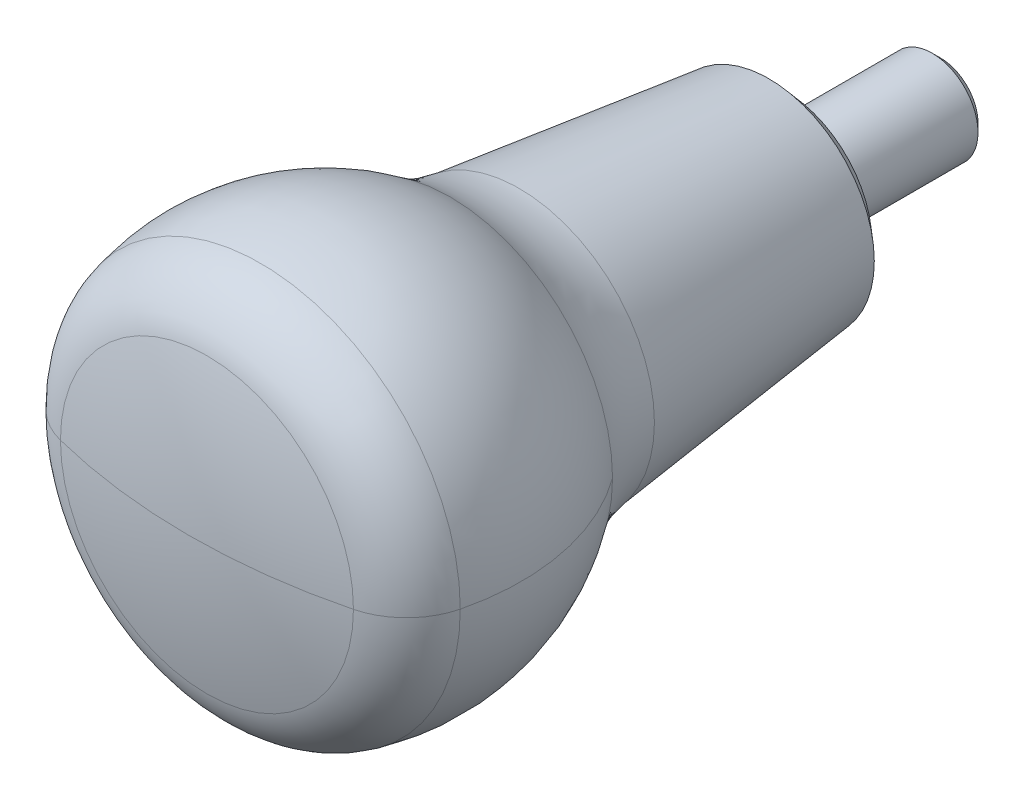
ISO-10303-21;
HEADER;
FILE_DESCRIPTION(('STEP AP214'),'2;1');
FILE_NAME('part.step','',(''),(''),'','','');
FILE_SCHEMA(('AUTOMOTIVE_DESIGN { 1 0 10303 214 1 1 1 1 }'));
ENDSEC;
DATA;
#1=APPLICATION_CONTEXT('core data for automotive mechanical design processes');
#2=APPLICATION_PROTOCOL_DEFINITION('international standard','automotive_design',2000,#1);
#3=PRODUCT_CONTEXT('',#1,'mechanical');
#4=PRODUCT('Part','Part','',(#3));
#5=PRODUCT_RELATED_PRODUCT_CATEGORY('part','',(#4));
#6=PRODUCT_DEFINITION_FORMATION('','',#4);
#7=PRODUCT_DEFINITION_CONTEXT('part definition',#1,'design');
#8=PRODUCT_DEFINITION('design','',#6,#7);
#9=PRODUCT_DEFINITION_SHAPE('','',#8);
#10=(LENGTH_UNIT() NAMED_UNIT(*) SI_UNIT(.MILLI.,.METRE.));
#11=(NAMED_UNIT(*) PLANE_ANGLE_UNIT() SI_UNIT($,.RADIAN.));
#12=(NAMED_UNIT(*) SI_UNIT($,.STERADIAN.) SOLID_ANGLE_UNIT());
#13=UNCERTAINTY_MEASURE_WITH_UNIT(LENGTH_MEASURE(1.E-05),#10,'distance_accuracy_value','');
#14=(GEOMETRIC_REPRESENTATION_CONTEXT(3) GLOBAL_UNCERTAINTY_ASSIGNED_CONTEXT((#13)) GLOBAL_UNIT_ASSIGNED_CONTEXT((#10,
#11,#12)) REPRESENTATION_CONTEXT('',''));
#15=CARTESIAN_POINT('',(0.,0.,0.));
#16=DIRECTION('',(0.,0.,1.));
#17=DIRECTION('',(1.,0.,0.));
#18=AXIS2_PLACEMENT_3D('',#15,#16,#17);
#19=CARTESIAN_POINT('',(0.,-2.04,-16.8));
#20=DIRECTION('',(0.,0.,-1.));
#21=DIRECTION('',(-1.,0.,0.));
#22=AXIS2_PLACEMENT_3D('',#19,#20,#21);
#23=PLANE('',#22);
#24=DIRECTION('',(0.866025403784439,0.5,0.));
#25=VECTOR('',#24,1.);
#26=CARTESIAN_POINT('',(-2.5,1.44337567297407,-16.8));
#27=LINE('',#26,#25);
#28=CARTESIAN_POINT('',(-2.5,1.44337567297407,-16.8));
#29=VERTEX_POINT('',#28);
#30=CARTESIAN_POINT('',(0.,2.88675134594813,-16.8));
#31=VERTEX_POINT('',#30);
#32=EDGE_CURVE('E32',#29,#31,#27,.T.);
#33=ORIENTED_EDGE('',*,*,#32,.F.);
#34=DIRECTION('',(0.,1.,0.));
#35=VECTOR('',#34,1.);
#36=CARTESIAN_POINT('',(-2.5,-1.44337567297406,-16.8));
#37=LINE('',#36,#35);
#38=CARTESIAN_POINT('',(-2.5,-1.44337567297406,-16.8));
#39=VERTEX_POINT('',#38);
#40=EDGE_CURVE('E214',#39,#29,#37,.T.);
#41=ORIENTED_EDGE('',*,*,#40,.F.);
#42=DIRECTION('',(-0.866025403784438,0.5,0.));
#43=VECTOR('',#42,1.);
#44=CARTESIAN_POINT('',(0.,-2.88675134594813,-16.8));
#45=LINE('',#44,#43);
#46=CARTESIAN_POINT('',(0.,-2.88675134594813,-16.8));
#47=VERTEX_POINT('',#46);
#48=EDGE_CURVE('E583',#47,#39,#45,.T.);
#49=ORIENTED_EDGE('',*,*,#48,.F.);
#50=DIRECTION('',(-0.866025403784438,-0.5,0.));
#51=VECTOR('',#50,1.);
#52=CARTESIAN_POINT('',(2.5,-1.44337567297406,-16.8));
#53=LINE('',#52,#51);
#54=CARTESIAN_POINT('',(2.5,-1.44337567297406,-16.8));
#55=VERTEX_POINT('',#54);
#56=EDGE_CURVE('E581',#55,#47,#53,.T.);
#57=ORIENTED_EDGE('',*,*,#56,.F.);
#58=DIRECTION('',(0.,-1.,0.));
#59=VECTOR('',#58,1.);
#60=CARTESIAN_POINT('',(2.5,1.44337567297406,-16.8));
#61=LINE('',#60,#59);
#62=CARTESIAN_POINT('',(2.5,1.44337567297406,-16.8));
#63=VERTEX_POINT('',#62);
#64=EDGE_CURVE('E574',#63,#55,#61,.T.);
#65=ORIENTED_EDGE('',*,*,#64,.F.);
#66=DIRECTION('',(0.866025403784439,-0.5,0.));
#67=VECTOR('',#66,1.);
#68=CARTESIAN_POINT('',(0.,2.88675134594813,-16.8));
#69=LINE('',#68,#67);
#70=EDGE_CURVE('E571',#31,#63,#69,.T.);
#71=ORIENTED_EDGE('',*,*,#70,.F.);
#72=EDGE_LOOP('',(#33,#41,#49,#57,#65,#71));
#73=FACE_BOUND('',#72,.T.);
#74=CARTESIAN_POINT('',(0.,0.,-16.8));
#75=DIRECTION('',(0.,0.,1.));
#76=DIRECTION('',(0.,1.,0.));
#77=AXIS2_PLACEMENT_3D('',#74,#75,#76);
#78=CIRCLE('',#77,4.08000000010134);
#79=CARTESIAN_POINT('',(0.,4.08000000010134,-16.8));
#80=VERTEX_POINT('',#79);
#81=EDGE_CURVE('E189',#80,#80,#78,.T.);
#82=ORIENTED_EDGE('',*,*,#81,.F.);
#83=EDGE_LOOP('',(#82));
#84=FACE_BOUND('',#83,.T.);
#85=ADVANCED_FACE('F14',(#73,#84),#23,.T.);
#86=CARTESIAN_POINT('',(0.,0.,-15.880000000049));
#87=DIRECTION('',(0.,0.,1.));
#88=DIRECTION('',(0.,1.,0.));
#89=AXIS2_PLACEMENT_3D('',#86,#87,#88);
#90=CONICAL_SURFACE('',#89,5.0000000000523,0.785398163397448);
#91=CARTESIAN_POINT('',(0.,0.,-15.88));
#92=DIRECTION('',(0.,0.,-1.));
#93=DIRECTION('',(0.,-1.,0.));
#94=AXIS2_PLACEMENT_3D('',#91,#92,#93);
#95=CIRCLE('',#94,5.);
#96=CARTESIAN_POINT('',(0.,-5.,-15.88));
#97=VERTEX_POINT('',#96);
#98=EDGE_CURVE('E186',#97,#97,#95,.F.);
#99=ORIENTED_EDGE('',*,*,#98,.F.);
#100=EDGE_LOOP('',(#99));
#101=FACE_BOUND('',#100,.T.);
#102=ORIENTED_EDGE('',*,*,#81,.T.);
#103=EDGE_LOOP('',(#102));
#104=FACE_BOUND('',#103,.T.);
#105=ADVANCED_FACE('F442',(#101,#104),#90,.T.);
#106=CARTESIAN_POINT('',(0.,0.,-9.2));
#107=DIRECTION('',(0.,0.,-1.));
#108=DIRECTION('',(0.,-1.,0.));
#109=AXIS2_PLACEMENT_3D('',#106,#107,#108);
#110=CYLINDRICAL_SURFACE('',#109,5.);
#111=CARTESIAN_POINT('',(0.,0.,-2.51999999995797));
#112=DIRECTION('',(0.,0.,-1.));
#113=DIRECTION('',(0.,-1.,0.));
#114=AXIS2_PLACEMENT_3D('',#111,#112,#113);
#115=CIRCLE('',#114,4.99999999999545);
#116=CARTESIAN_POINT('',(0.,-4.99999999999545,-2.51999999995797));
#117=VERTEX_POINT('',#116);
#118=EDGE_CURVE('E178',#117,#117,#115,.F.);
#119=ORIENTED_EDGE('',*,*,#118,.F.);
#120=EDGE_LOOP('',(#119));
#121=FACE_BOUND('',#120,.T.);
#122=ORIENTED_EDGE('',*,*,#98,.T.);
#123=EDGE_LOOP('',(#122));
#124=FACE_BOUND('',#123,.T.);
#125=ADVANCED_FACE('F451',(#121,#124),#110,.T.);
#126=CARTESIAN_POINT('',(0.,0.,-2.51999999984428));
#127=DIRECTION('',(0.,0.,-1.));
#128=DIRECTION('',(-1.,0.,0.));
#129=AXIS2_PLACEMENT_3D('',#126,#127,#128);
#130=CONICAL_SURFACE('',#129,4.99999999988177,0.785398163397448);
#131=CARTESIAN_POINT('',(0.,0.,-1.60000000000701));
#132=DIRECTION('',(0.,0.,-1.));
#133=DIRECTION('',(-1.,0.,0.));
#134=AXIS2_PLACEMENT_3D('',#131,#132,#133);
#135=CIRCLE('',#134,4.0800000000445);
#136=CARTESIAN_POINT('',(-4.0800000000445,0.,-1.60000000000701));
#137=VERTEX_POINT('',#136);
#138=EDGE_CURVE('E104',#137,#137,#135,.F.);
#139=ORIENTED_EDGE('',*,*,#138,.F.);
#140=EDGE_LOOP('',(#139));
#141=FACE_BOUND('',#140,.T.);
#142=ORIENTED_EDGE('',*,*,#118,.T.);
#143=EDGE_LOOP('',(#142));
#144=FACE_BOUND('',#143,.T.);
#145=ADVANCED_FACE('F460',(#141,#144),#130,.T.);
#146=CARTESIAN_POINT('',(0.,-4.04,-1.6));
#147=DIRECTION('',(0.,0.,1.));
#148=DIRECTION('',(1.,0.,0.));
#149=AXIS2_PLACEMENT_3D('',#146,#147,#148);
#150=PLANE('',#149);
#151=ORIENTED_EDGE('',*,*,#138,.T.);
#152=EDGE_LOOP('',(#151));
#153=FACE_BOUND('',#152,.T.);
#154=CARTESIAN_POINT('',(0.,0.,-1.6));
#155=DIRECTION('',(0.,0.,1.));
#156=DIRECTION('',(-1.,0.,0.));
#157=AXIS2_PLACEMENT_3D('',#154,#155,#156);
#158=CIRCLE('',#157,4.);
#159=CARTESIAN_POINT('',(0.,-4.,-1.6));
#160=VERTEX_POINT('',#159);
#161=CARTESIAN_POINT('',(-4.,0.,-1.6));
#162=VERTEX_POINT('',#161);
#163=EDGE_CURVE('E88',#160,#162,#158,.F.);
#164=ORIENTED_EDGE('',*,*,#163,.T.);
#165=CARTESIAN_POINT('',(0.,0.,-1.6));
#166=DIRECTION('',(0.,0.,1.));
#167=DIRECTION('',(1.,0.,0.));
#168=AXIS2_PLACEMENT_3D('',#165,#166,#167);
#169=CIRCLE('',#168,4.);
#170=CARTESIAN_POINT('',(4.,0.,-1.6));
#171=VERTEX_POINT('',#170);
#172=EDGE_CURVE('E92',#162,#171,#169,.F.);
#173=ORIENTED_EDGE('',*,*,#172,.T.);
#174=CARTESIAN_POINT('',(0.,0.,-1.6));
#175=DIRECTION('',(0.,0.,1.));
#176=DIRECTION('',(0.,-1.,0.));
#177=AXIS2_PLACEMENT_3D('',#174,#175,#176);
#178=CIRCLE('',#177,4.);
#179=EDGE_CURVE('E95',#171,#160,#178,.F.);
#180=ORIENTED_EDGE('',*,*,#179,.T.);
#181=EDGE_LOOP('',(#164,#173,#180));
#182=FACE_BOUND('',#181,.T.);
#183=ADVANCED_FACE('F91',(#153,#182),#150,.T.);
#184=CARTESIAN_POINT('',(0.,0.,-1.4));
#185=DIRECTION('',(0.,0.,1.));
#186=DIRECTION('',(1.,0.,0.));
#187=AXIS2_PLACEMENT_3D('',#184,#185,#186);
#188=TOROIDAL_SURFACE('',#187,4.,0.2);
#189=CARTESIAN_POINT('',(0.,0.,-1.4));
#190=DIRECTION('',(0.,0.,-1.));
#191=DIRECTION('',(0.,-1.,0.));
#192=AXIS2_PLACEMENT_3D('',#189,#190,#191);
#193=CIRCLE('',#192,3.8);
#194=CARTESIAN_POINT('',(0.,-3.8,-1.4));
#195=VERTEX_POINT('',#194);
#196=EDGE_CURVE('E99',#195,#195,#193,.F.);
#197=ORIENTED_EDGE('',*,*,#196,.F.);
#198=EDGE_LOOP('',(#197));
#199=FACE_BOUND('',#198,.T.);
#200=ORIENTED_EDGE('',*,*,#163,.F.);
#201=ORIENTED_EDGE('',*,*,#179,.F.);
#202=ORIENTED_EDGE('',*,*,#172,.F.);
#203=EDGE_LOOP('',(#200,#201,#202));
#204=FACE_BOUND('',#203,.T.);
#205=ADVANCED_FACE('F102',(#199,#204),#188,.F.);
#206=CARTESIAN_POINT('',(0.,0.,-0.925));
#207=DIRECTION('',(0.,0.,-1.));
#208=DIRECTION('',(0.,-1.,0.));
#209=AXIS2_PLACEMENT_3D('',#206,#207,#208);
#210=CYLINDRICAL_SURFACE('',#209,3.8);
#211=ORIENTED_EDGE('',*,*,#196,.T.);
#212=EDGE_LOOP('',(#211));
#213=FACE_BOUND('',#212,.T.);
#214=CARTESIAN_POINT('',(0.,0.,-0.45));
#215=DIRECTION('',(0.,0.,1.));
#216=DIRECTION('',(1.,0.,0.));
#217=AXIS2_PLACEMENT_3D('',#214,#215,#216);
#218=CIRCLE('',#217,3.8);
#219=CARTESIAN_POINT('',(3.8,0.,-0.45));
#220=VERTEX_POINT('',#219);
#221=EDGE_CURVE('E153',#220,#220,#218,.F.);
#222=ORIENTED_EDGE('',*,*,#221,.T.);
#223=EDGE_LOOP('',(#222));
#224=FACE_BOUND('',#223,.T.);
#225=ADVANCED_FACE('F123',(#213,#224),#210,.T.);
#226=CARTESIAN_POINT('',(0.,0.,-0.45));
#227=DIRECTION('',(0.,0.,1.));
#228=DIRECTION('',(1.,0.,0.));
#229=AXIS2_PLACEMENT_3D('',#226,#227,#228);
#230=TOROIDAL_SURFACE('',#229,4.25,0.45);
#231=CARTESIAN_POINT('',(0.,0.,0.));
#232=DIRECTION('',(0.,0.,-1.));
#233=DIRECTION('',(0.,-1.,0.));
#234=AXIS2_PLACEMENT_3D('',#231,#232,#233);
#235=CIRCLE('',#234,4.25);
#236=CARTESIAN_POINT('',(-4.25,0.,0.));
#237=VERTEX_POINT('',#236);
#238=CARTESIAN_POINT('',(0.,-4.25,0.));
#239=VERTEX_POINT('',#238);
#240=EDGE_CURVE('E137',#237,#239,#235,.F.);
#241=ORIENTED_EDGE('',*,*,#240,.F.);
#242=CARTESIAN_POINT('',(0.,0.,0.));
#243=DIRECTION('',(0.,0.,-1.));
#244=DIRECTION('',(-1.,0.,0.));
#245=AXIS2_PLACEMENT_3D('',#242,#243,#244);
#246=CIRCLE('',#245,4.25);
#247=CARTESIAN_POINT('',(4.25,0.,0.));
#248=VERTEX_POINT('',#247);
#249=EDGE_CURVE('E626',#248,#237,#246,.F.);
#250=ORIENTED_EDGE('',*,*,#249,.F.);
#251=CARTESIAN_POINT('',(0.,0.,0.));
#252=DIRECTION('',(0.,0.,-1.));
#253=DIRECTION('',(1.,0.,0.));
#254=AXIS2_PLACEMENT_3D('',#251,#252,#253);
#255=CIRCLE('',#254,4.25);
#256=EDGE_CURVE('E149',#239,#248,#255,.F.);
#257=ORIENTED_EDGE('',*,*,#256,.F.);
#258=EDGE_LOOP('',(#241,#250,#257));
#259=FACE_BOUND('',#258,.T.);
#260=ORIENTED_EDGE('',*,*,#221,.F.);
#261=EDGE_LOOP('',(#260));
#262=FACE_BOUND('',#261,.T.);
#263=ADVANCED_FACE('F111',(#259,#262),#230,.F.);
#264=CARTESIAN_POINT('',(0.,-5.125,0.));
#265=DIRECTION('',(0.,0.,-1.));
#266=DIRECTION('',(-1.,0.,0.));
#267=AXIS2_PLACEMENT_3D('',#264,#265,#266);
#268=PLANE('',#267);
#269=ORIENTED_EDGE('',*,*,#249,.T.);
#270=ORIENTED_EDGE('',*,*,#240,.T.);
#271=ORIENTED_EDGE('',*,*,#256,.T.);
#272=EDGE_LOOP('',(#269,#270,#271));
#273=FACE_BOUND('',#272,.T.);
#274=CARTESIAN_POINT('',(0.,0.,0.));
#275=DIRECTION('',(0.,0.,-1.));
#276=DIRECTION('',(0.,-1.,0.));
#277=AXIS2_PLACEMENT_3D('',#274,#275,#276);
#278=CIRCLE('',#277,6.);
#279=CARTESIAN_POINT('',(0.,-6.,0.));
#280=VERTEX_POINT('',#279);
#281=EDGE_CURVE('E197',#280,#280,#278,.F.);
#282=ORIENTED_EDGE('',*,*,#281,.F.);
#283=EDGE_LOOP('',(#282));
#284=FACE_BOUND('',#283,.T.);
#285=ADVANCED_FACE('F122',(#273,#284),#268,.T.);
#286=CARTESIAN_POINT('',(0.,0.,0.0999999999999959));
#287=DIRECTION('',(0.,0.,-1.));
#288=DIRECTION('',(0.,-1.,0.));
#289=AXIS2_PLACEMENT_3D('',#286,#287,#288);
#290=CYLINDRICAL_SURFACE('',#289,6.);
#291=CARTESIAN_POINT('',(0.,0.,0.2));
#292=DIRECTION('',(0.,0.,-1.));
#293=DIRECTION('',(0.,-1.,0.));
#294=AXIS2_PLACEMENT_3D('',#291,#292,#293);
#295=CIRCLE('',#294,6.);
#296=CARTESIAN_POINT('',(0.,-6.,0.2));
#297=VERTEX_POINT('',#296);
#298=EDGE_CURVE('E194',#297,#297,#295,.F.);
#299=ORIENTED_EDGE('',*,*,#298,.F.);
#300=EDGE_LOOP('',(#299));
#301=FACE_BOUND('',#300,.T.);
#302=ORIENTED_EDGE('',*,*,#281,.T.);
#303=EDGE_LOOP('',(#302));
#304=FACE_BOUND('',#303,.T.);
#305=ADVANCED_FACE('F305',(#301,#304),#290,.T.);
#306=CARTESIAN_POINT('',(0.,-7.75,0.2));
#307=DIRECTION('',(0.,0.,-1.));
#308=DIRECTION('',(-1.,0.,0.));
#309=AXIS2_PLACEMENT_3D('',#306,#307,#308);
#310=PLANE('',#309);
#311=ORIENTED_EDGE('',*,*,#298,.T.);
#312=EDGE_LOOP('',(#311));
#313=FACE_BOUND('',#312,.T.);
#314=CARTESIAN_POINT('',(0.,0.,0.200000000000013));
#315=DIRECTION('',(0.,0.,1.));
#316=DIRECTION('',(1.,0.,0.));
#317=AXIS2_PLACEMENT_3D('',#314,#315,#316);
#318=CIRCLE('',#317,9.5);
#319=CARTESIAN_POINT('',(9.5,0.,0.200000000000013));
#320=VERTEX_POINT('',#319);
#321=EDGE_CURVE('E190',#320,#320,#318,.T.);
#322=ORIENTED_EDGE('',*,*,#321,.F.);
#323=EDGE_LOOP('',(#322));
#324=FACE_BOUND('',#323,.T.);
#325=ADVANCED_FACE('F302',(#313,#324),#310,.T.);
#326=CARTESIAN_POINT('',(-5.14556505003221E-05,0.,0.199172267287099));
#327=DIRECTION('',(0.,1.,0.));
#328=DIRECTION('',(1.,0.,0.));
#329=AXIS2_PLACEMENT_3D('',#326,#327,#328);
#330=CIRCLE('',#329,65.0008277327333);
#331=TRIMMED_CURVE('',#330,(PARAMETER_VALUE(-1.57079553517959)),
(PARAMETER_VALUE(1.57079553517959)),.T.,.PARAMETER.);
#332=CARTESIAN_POINT('',(0.,0.,0.199172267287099));
#333=DIRECTION('',(0.,0.,1.));
#334=AXIS1_PLACEMENT('',#332,#333);
#335=SURFACE_OF_REVOLUTION('',#331,#334);
#336=CARTESIAN_POINT('',(-5.14556505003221E-05,0.,0.199172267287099));
#337=DIRECTION('',(0.,1.,0.));
#338=DIRECTION('',(1.,0.,0.));
#339=AXIS2_PLACEMENT_3D('',#336,#337,#338);
#340=CIRCLE('',#339,65.0008277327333);
#341=CARTESIAN_POINT('',(15.9766122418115,0.,63.2059482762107));
#342=VERTEX_POINT('',#341);
#343=CARTESIAN_POINT('',(0.,0.,65.2));
#344=VERTEX_POINT('',#343);
#345=EDGE_CURVE('E287',#342,#344,#340,.F.);
#346=ORIENTED_EDGE('',*,*,#345,.F.);
#347=CARTESIAN_POINT('',(0.,0.,63.2059482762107));
#348=DIRECTION('',(0.,0.,1.));
#349=DIRECTION('',(1.,0.,0.));
#350=AXIS2_PLACEMENT_3D('',#347,#348,#349);
#351=CIRCLE('',#350,15.9766122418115);
#352=CARTESIAN_POINT('',(-15.9766122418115,0.,63.2059482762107));
#353=VERTEX_POINT('',#352);
#354=EDGE_CURVE('E284',#353,#342,#351,.F.);
#355=ORIENTED_EDGE('',*,*,#354,.F.);
#356=CARTESIAN_POINT('',(5.14556505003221E-05,0.,0.199172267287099));
#357=DIRECTION('',(0.,-1.,0.));
#358=DIRECTION('',(-1.,0.,0.));
#359=AXIS2_PLACEMENT_3D('',#356,#357,#358);
#360=CIRCLE('',#359,65.0008277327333);
#361=EDGE_CURVE('E193',#344,#353,#360,.T.);
#362=ORIENTED_EDGE('',*,*,#361,.F.);
#363=EDGE_LOOP('',(#346,#355,#362));
#364=FACE_BOUND('',#363,.T.);
#365=ADVANCED_FACE('F298',(#364),#335,.F.);
#366=CARTESIAN_POINT('',(0.,0.,1.92843217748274));
#367=DIRECTION('',(0.,0.,1.));
#368=DIRECTION('',(1.,0.,0.));
#369=AXIS2_PLACEMENT_3D('',#366,#367,#368);
#370=CONICAL_SURFACE('',#369,11.5,0.858106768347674);
#371=CARTESIAN_POINT('',(0.,0.,1.9284321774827));
#372=DIRECTION('',(0.,0.,1.));
#373=DIRECTION('',(0.,-1.,0.));
#374=AXIS2_PLACEMENT_3D('',#371,#372,#373);
#375=CIRCLE('',#374,11.5);
#376=CARTESIAN_POINT('',(0.,-11.5,1.9284321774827));
#377=VERTEX_POINT('',#376);
#378=EDGE_CURVE('E286',#377,#377,#375,.T.);
#379=ORIENTED_EDGE('',*,*,#378,.F.);
#380=EDGE_LOOP('',(#379));
#381=FACE_BOUND('',#380,.T.);
#382=ORIENTED_EDGE('',*,*,#321,.T.);
#383=EDGE_LOOP('',(#382));
#384=FACE_BOUND('',#383,.T.);
#385=ADVANCED_FACE('F301',(#381,#384),#370,.T.);
#386=CARTESIAN_POINT('',(-5.14556505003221E-05,0.,0.199172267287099));
#387=DIRECTION('',(0.,1.,0.));
#388=DIRECTION('',(1.,0.,0.));
#389=AXIS2_PLACEMENT_3D('',#386,#387,#388);
#390=CIRCLE('',#389,65.0008277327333);
#391=TRIMMED_CURVE('',#390,(PARAMETER_VALUE(-1.57079553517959)),
(PARAMETER_VALUE(1.57079553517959)),.T.,.PARAMETER.);
#392=CARTESIAN_POINT('',(0.,0.,0.199172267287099));
#393=DIRECTION('',(0.,0.,1.));
#394=AXIS1_PLACEMENT('',#392,#393);
#395=SURFACE_OF_REVOLUTION('',#391,#394);
#396=CARTESIAN_POINT('',(0.,0.,63.2059482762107));
#397=DIRECTION('',(0.,0.,1.));
#398=DIRECTION('',(1.,0.,0.));
#399=AXIS2_PLACEMENT_3D('',#396,#397,#398);
#400=CIRCLE('',#399,15.9766122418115);
#401=CARTESIAN_POINT('',(0.,-15.9766122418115,63.2059482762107));
#402=VERTEX_POINT('',#401);
#403=EDGE_CURVE('E333',#342,#402,#400,.F.);
#404=ORIENTED_EDGE('',*,*,#403,.F.);
#405=ORIENTED_EDGE('',*,*,#345,.T.);
#406=ORIENTED_EDGE('',*,*,#361,.T.);
#407=CARTESIAN_POINT('',(0.,0.,63.2059482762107));
#408=DIRECTION('',(0.,0.,1.));
#409=DIRECTION('',(1.,0.,0.));
#410=AXIS2_PLACEMENT_3D('',#407,#408,#409);
#411=CIRCLE('',#410,15.9766122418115);
#412=EDGE_CURVE('E336',#402,#353,#411,.F.);
#413=ORIENTED_EDGE('',*,*,#412,.F.);
#414=EDGE_LOOP('',(#404,#405,#406,#413));
#415=FACE_BOUND('',#414,.T.);
#416=ADVANCED_FACE('F275',(#415),#395,.F.);
#417=CARTESIAN_POINT('',(0.,0.,55.451386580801));
#418=DIRECTION('',(0.,0.,1.));
#419=DIRECTION('',(1.,0.,0.));
#420=AXIS2_PLACEMENT_3D('',#417,#418,#419);
#421=TOROIDAL_SURFACE('',#420,14.0102198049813,7.99999539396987);
#422=CARTESIAN_POINT('',(-14.0102198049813,0.,55.451386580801));
#423=DIRECTION('',(0.,-1.,0.));
#424=DIRECTION('',(-1.,0.,0.));
#425=AXIS2_PLACEMENT_3D('',#422,#423,#424);
#426=CIRCLE('',#425,7.99999539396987);
#427=CARTESIAN_POINT('',(-21.7797205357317,0.,57.3578977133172));
#428=VERTEX_POINT('',#427);
#429=EDGE_CURVE('E259',#353,#428,#426,.T.);
#430=ORIENTED_EDGE('',*,*,#429,.F.);
#431=ORIENTED_EDGE('',*,*,#354,.T.);
#432=CARTESIAN_POINT('',(14.0102198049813,0.,55.451386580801));
#433=DIRECTION('',(0.,1.,0.));
#434=DIRECTION('',(1.,0.,0.));
#435=AXIS2_PLACEMENT_3D('',#432,#433,#434);
#436=CIRCLE('',#435,7.99999539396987);
#437=CARTESIAN_POINT('',(21.7797205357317,0.,57.3578977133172));
#438=VERTEX_POINT('',#437);
#439=EDGE_CURVE('E282',#438,#342,#436,.F.);
#440=ORIENTED_EDGE('',*,*,#439,.F.);
#441=CARTESIAN_POINT('',(0.,0.,57.3578977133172));
#442=DIRECTION('',(0.,0.,1.));
#443=DIRECTION('',(1.,0.,0.));
#444=AXIS2_PLACEMENT_3D('',#441,#442,#443);
#445=CIRCLE('',#444,21.7797205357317);
#446=EDGE_CURVE('E253',#428,#438,#445,.F.);
#447=ORIENTED_EDGE('',*,*,#446,.F.);
#448=EDGE_LOOP('',(#430,#431,#440,#447));
#449=FACE_BOUND('',#448,.T.);
#450=ADVANCED_FACE('F270',(#449),#421,.T.);
#451=CARTESIAN_POINT('',(0.,0.,29.1578448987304));
#452=DIRECTION('',(0.,0.,1.));
#453=DIRECTION('',(1.,0.,0.));
#454=AXIS2_PLACEMENT_3D('',#451,#452,#453);
#455=CONICAL_SURFACE('',#454,14.7528672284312,0.118898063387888);
#456=CARTESIAN_POINT('',(0.,0.,29.1578448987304));
#457=DIRECTION('',(0.,0.,1.));
#458=DIRECTION('',(1.,0.,0.));
#459=AXIS2_PLACEMENT_3D('',#456,#457,#458);
#460=CIRCLE('',#459,14.7528672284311);
#461=CARTESIAN_POINT('',(14.7528672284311,0.,29.1578448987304));
#462=VERTEX_POINT('',#461);
#463=EDGE_CURVE('E251',#462,#462,#460,.F.);
#464=ORIENTED_EDGE('',*,*,#463,.T.);
#465=EDGE_LOOP('',(#464));
#466=FACE_BOUND('',#465,.T.);
#467=ORIENTED_EDGE('',*,*,#378,.T.);
#468=EDGE_LOOP('',(#467));
#469=FACE_BOUND('',#468,.T.);
#470=ADVANCED_FACE('F266',(#466,#469),#455,.T.);
#471=CARTESIAN_POINT('',(0.,0.,55.451386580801));
#472=DIRECTION('',(0.,0.,1.));
#473=DIRECTION('',(1.,0.,0.));
#474=AXIS2_PLACEMENT_3D('',#471,#472,#473);
#475=TOROIDAL_SURFACE('',#474,14.0102198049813,7.99999539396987);
#476=CARTESIAN_POINT('',(0.,0.,57.3578977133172));
#477=DIRECTION('',(0.,0.,1.));
#478=DIRECTION('',(1.,0.,0.));
#479=AXIS2_PLACEMENT_3D('',#476,#477,#478);
#480=CIRCLE('',#479,21.7797205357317);
#481=CARTESIAN_POINT('',(0.,-21.7797205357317,57.3578977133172));
#482=VERTEX_POINT('',#481);
#483=EDGE_CURVE('E342',#482,#428,#480,.F.);
#484=ORIENTED_EDGE('',*,*,#483,.F.);
#485=CARTESIAN_POINT('',(0.,0.,57.3578977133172));
#486=DIRECTION('',(0.,0.,1.));
#487=DIRECTION('',(1.,0.,0.));
#488=AXIS2_PLACEMENT_3D('',#485,#486,#487);
#489=CIRCLE('',#488,21.7797205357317);
#490=EDGE_CURVE('E346',#438,#482,#489,.F.);
#491=ORIENTED_EDGE('',*,*,#490,.F.);
#492=ORIENTED_EDGE('',*,*,#439,.T.);
#493=ORIENTED_EDGE('',*,*,#403,.T.);
#494=ORIENTED_EDGE('',*,*,#412,.T.);
#495=ORIENTED_EDGE('',*,*,#429,.T.);
#496=EDGE_LOOP('',(#484,#491,#492,#493,#494,#495));
#497=FACE_BOUND('',#496,.T.);
#498=ADVANCED_FACE('F263',(#497),#475,.T.);
#499=CARTESIAN_POINT('',(-2.50001842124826,0.,51.4001080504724));
#500=DIRECTION('',(0.,1.,0.));
#501=DIRECTION('',(1.,0.,0.));
#502=AXIS2_PLACEMENT_3D('',#499,#500,#501);
#503=CIRCLE('',#502,25.0000196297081);
#504=TRIMMED_CURVE('',#503,(PARAMETER_VALUE(-1.47062824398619)),
(PARAMETER_VALUE(1.47062824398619)),.T.,.PARAMETER.);
#505=CARTESIAN_POINT('',(0.,0.,51.4001080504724));
#506=DIRECTION('',(0.,0.,1.));
#507=AXIS1_PLACEMENT('',#505,#506);
#508=SURFACE_OF_REVOLUTION('',#504,#507);
#509=CARTESIAN_POINT('',(2.50001842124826,0.,51.4001080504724));
#510=DIRECTION('',(0.,-1.,0.));
#511=DIRECTION('',(-1.,0.,0.));
#512=AXIS2_PLACEMENT_3D('',#509,#510,#511);
#513=CIRCLE('',#512,25.0000196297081);
#514=CARTESIAN_POINT('',(-17.7072603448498,0.,36.680499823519));
#515=VERTEX_POINT('',#514);
#516=EDGE_CURVE('E24',#428,#515,#513,.T.);
#517=ORIENTED_EDGE('',*,*,#516,.F.);
#518=ORIENTED_EDGE('',*,*,#446,.T.);
#519=CARTESIAN_POINT('',(-2.50001842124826,0.,51.4001080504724));
#520=DIRECTION('',(0.,1.,0.));
#521=DIRECTION('',(1.,0.,0.));
#522=AXIS2_PLACEMENT_3D('',#519,#520,#521);
#523=CIRCLE('',#522,25.0000196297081);
#524=CARTESIAN_POINT('',(17.7072603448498,0.,36.680499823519));
#525=VERTEX_POINT('',#524);
#526=EDGE_CURVE('E249',#525,#438,#523,.F.);
#527=ORIENTED_EDGE('',*,*,#526,.F.);
#528=CARTESIAN_POINT('',(0.,0.,36.680499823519));
#529=DIRECTION('',(0.,0.,1.));
#530=DIRECTION('',(1.,0.,0.));
#531=AXIS2_PLACEMENT_3D('',#528,#529,#530);
#532=CIRCLE('',#531,17.7072603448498);
#533=EDGE_CURVE('E41',#525,#515,#532,.T.);
#534=ORIENTED_EDGE('',*,*,#533,.T.);
#535=EDGE_LOOP('',(#517,#518,#527,#534));
#536=FACE_BOUND('',#535,.T.);
#537=ADVANCED_FACE('F242',(#536),#508,.F.);
#538=CARTESIAN_POINT('',(0.,0.,27.2599549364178));
#539=DIRECTION('',(0.,0.,1.));
#540=DIRECTION('',(1.,0.,0.));
#541=AXIS2_PLACEMENT_3D('',#538,#539,#540);
#542=TOROIDAL_SURFACE('',#541,30.6399064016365,16.0000000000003);
#543=CARTESIAN_POINT('',(0.,0.,36.680499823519));
#544=DIRECTION('',(0.,0.,1.));
#545=DIRECTION('',(1.,0.,0.));
#546=AXIS2_PLACEMENT_3D('',#543,#544,#545);
#547=CIRCLE('',#546,17.7072603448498);
#548=EDGE_CURVE('E9',#515,#525,#547,.T.);
#549=ORIENTED_EDGE('',*,*,#548,.F.);
#550=ORIENTED_EDGE('',*,*,#533,.F.);
#551=EDGE_LOOP('',(#549,#550));
#552=FACE_BOUND('',#551,.T.);
#553=ORIENTED_EDGE('',*,*,#463,.F.);
#554=EDGE_LOOP('',(#553));
#555=FACE_BOUND('',#554,.T.);
#556=ADVANCED_FACE('F236',(#552,#555),#542,.F.);
#557=CARTESIAN_POINT('',(-2.50001842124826,0.,51.4001080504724));
#558=DIRECTION('',(0.,1.,0.));
#559=DIRECTION('',(1.,0.,0.));
#560=AXIS2_PLACEMENT_3D('',#557,#558,#559);
#561=CIRCLE('',#560,25.0000196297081);
#562=TRIMMED_CURVE('',#561,(PARAMETER_VALUE(-1.47062824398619)),
(PARAMETER_VALUE(1.47062824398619)),.T.,.PARAMETER.);
#563=CARTESIAN_POINT('',(0.,0.,51.4001080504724));
#564=DIRECTION('',(0.,0.,1.));
#565=AXIS1_PLACEMENT('',#563,#564);
#566=SURFACE_OF_REVOLUTION('',#562,#565);
#567=ORIENTED_EDGE('',*,*,#548,.T.);
#568=ORIENTED_EDGE('',*,*,#526,.T.);
#569=ORIENTED_EDGE('',*,*,#490,.T.);
#570=ORIENTED_EDGE('',*,*,#483,.T.);
#571=ORIENTED_EDGE('',*,*,#516,.T.);
#572=EDGE_LOOP('',(#567,#568,#569,#570,#571));
#573=FACE_BOUND('',#572,.T.);
#574=ADVANCED_FACE('F231',(#573),#566,.F.);
#575=CARTESIAN_POINT('',(-2.5,1.44337567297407,-12.55));
#576=DIRECTION('',(-0.5,0.866025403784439,0.));
#577=DIRECTION('',(-0.866025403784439,-0.5,0.));
#578=AXIS2_PLACEMENT_3D('',#575,#576,#577);
#579=PLANE('',#578);
#580=ORIENTED_EDGE('',*,*,#32,.T.);
#581=DIRECTION('',(0.,0.,-1.));
#582=VECTOR('',#581,1.);
#583=CARTESIAN_POINT('',(0.,2.88675134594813,-12.55));
#584=LINE('',#583,#582);
#585=CARTESIAN_POINT('',(0.,2.88675134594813,-12.55));
#586=VERTEX_POINT('',#585);
#587=EDGE_CURVE('E225',#586,#31,#584,.T.);
#588=ORIENTED_EDGE('',*,*,#587,.F.);
#589=DIRECTION('',(0.866025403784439,0.5,0.));
#590=VECTOR('',#589,1.);
#591=CARTESIAN_POINT('',(-2.5,1.44337567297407,-12.55));
#592=LINE('',#591,#590);
#593=CARTESIAN_POINT('',(-2.5,1.44337567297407,-12.55));
#594=VERTEX_POINT('',#593);
#595=EDGE_CURVE('E586',#594,#586,#592,.T.);
#596=ORIENTED_EDGE('',*,*,#595,.F.);
#597=DIRECTION('',(0.,0.,-1.));
#598=VECTOR('',#597,1.);
#599=CARTESIAN_POINT('',(-2.5,1.44337567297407,-12.55));
#600=LINE('',#599,#598);
#601=EDGE_CURVE('E202',#594,#29,#600,.T.);
#602=ORIENTED_EDGE('',*,*,#601,.T.);
#603=EDGE_LOOP('',(#580,#588,#596,#602));
#604=FACE_BOUND('',#603,.T.);
#605=ADVANCED_FACE('F235',(#604),#579,.F.);
#606=CARTESIAN_POINT('',(-2.5,-1.44337567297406,-12.55));
#607=DIRECTION('',(-1.,0.,0.));
#608=DIRECTION('',(0.,0.,1.));
#609=AXIS2_PLACEMENT_3D('',#606,#607,#608);
#610=PLANE('',#609);
#611=ORIENTED_EDGE('',*,*,#40,.T.);
#612=ORIENTED_EDGE('',*,*,#601,.F.);
#613=DIRECTION('',(0.,1.,0.));
#614=VECTOR('',#613,1.);
#615=CARTESIAN_POINT('',(-2.5,-1.44337567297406,-12.55));
#616=LINE('',#615,#614);
#617=CARTESIAN_POINT('',(-2.5,-1.44337567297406,-12.55));
#618=VERTEX_POINT('',#617);
#619=EDGE_CURVE('E227',#618,#594,#616,.T.);
#620=ORIENTED_EDGE('',*,*,#619,.F.);
#621=DIRECTION('',(0.,0.,-1.));
#622=VECTOR('',#621,1.);
#623=CARTESIAN_POINT('',(-2.5,-1.44337567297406,-12.55));
#624=LINE('',#623,#622);
#625=EDGE_CURVE('E205',#618,#39,#624,.T.);
#626=ORIENTED_EDGE('',*,*,#625,.T.);
#627=EDGE_LOOP('',(#611,#612,#620,#626));
#628=FACE_BOUND('',#627,.T.);
#629=ADVANCED_FACE('F379',(#628),#610,.F.);
#630=CARTESIAN_POINT('',(0.,-2.88675134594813,-12.55));
#631=DIRECTION('',(-0.5,-0.866025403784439,0.));
#632=DIRECTION('',(0.866025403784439,-0.5,0.));
#633=AXIS2_PLACEMENT_3D('',#630,#631,#632);
#634=PLANE('',#633);
#635=ORIENTED_EDGE('',*,*,#48,.T.);
#636=ORIENTED_EDGE('',*,*,#625,.F.);
#637=DIRECTION('',(-0.866025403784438,0.5,0.));
#638=VECTOR('',#637,1.);
#639=CARTESIAN_POINT('',(0.,-2.88675134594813,-12.55));
#640=LINE('',#639,#638);
#641=CARTESIAN_POINT('',(0.,-2.88675134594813,-12.55));
#642=VERTEX_POINT('',#641);
#643=EDGE_CURVE('E599',#642,#618,#640,.T.);
#644=ORIENTED_EDGE('',*,*,#643,.F.);
#645=DIRECTION('',(0.,0.,-1.));
#646=VECTOR('',#645,1.);
#647=CARTESIAN_POINT('',(0.,-2.88675134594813,-12.55));
#648=LINE('',#647,#646);
#649=EDGE_CURVE('E211',#642,#47,#648,.T.);
#650=ORIENTED_EDGE('',*,*,#649,.T.);
#651=EDGE_LOOP('',(#635,#636,#644,#650));
#652=FACE_BOUND('',#651,.T.);
#653=ADVANCED_FACE('F386',(#652),#634,.F.);
#654=CARTESIAN_POINT('',(2.5,-1.44337567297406,-12.55));
#655=DIRECTION('',(0.5,-0.866025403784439,0.));
#656=DIRECTION('',(0.866025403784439,0.5,0.));
#657=AXIS2_PLACEMENT_3D('',#654,#655,#656);
#658=PLANE('',#657);
#659=ORIENTED_EDGE('',*,*,#56,.T.);
#660=ORIENTED_EDGE('',*,*,#649,.F.);
#661=DIRECTION('',(-0.866025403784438,-0.5,0.));
#662=VECTOR('',#661,1.);
#663=CARTESIAN_POINT('',(2.5,-1.44337567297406,-12.55));
#664=LINE('',#663,#662);
#665=CARTESIAN_POINT('',(2.5,-1.44337567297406,-12.55));
#666=VERTEX_POINT('',#665);
#667=EDGE_CURVE('E597',#666,#642,#664,.T.);
#668=ORIENTED_EDGE('',*,*,#667,.F.);
#669=DIRECTION('',(0.,0.,-1.));
#670=VECTOR('',#669,1.);
#671=CARTESIAN_POINT('',(2.5,-1.44337567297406,-12.55));
#672=LINE('',#671,#670);
#673=EDGE_CURVE('E219',#666,#55,#672,.T.);
#674=ORIENTED_EDGE('',*,*,#673,.T.);
#675=EDGE_LOOP('',(#659,#660,#668,#674));
#676=FACE_BOUND('',#675,.T.);
#677=ADVANCED_FACE('F395',(#676),#658,.F.);
#678=CARTESIAN_POINT('',(2.5,1.44337567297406,-12.55));
#679=DIRECTION('',(1.,0.,0.));
#680=DIRECTION('',(0.,1.,0.));
#681=AXIS2_PLACEMENT_3D('',#678,#679,#680);
#682=PLANE('',#681);
#683=ORIENTED_EDGE('',*,*,#64,.T.);
#684=ORIENTED_EDGE('',*,*,#673,.F.);
#685=DIRECTION('',(0.,-1.,0.));
#686=VECTOR('',#685,1.);
#687=CARTESIAN_POINT('',(2.5,1.44337567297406,-12.55));
#688=LINE('',#687,#686);
#689=CARTESIAN_POINT('',(2.5,1.44337567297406,-12.55));
#690=VERTEX_POINT('',#689);
#691=EDGE_CURVE('E592',#690,#666,#688,.T.);
#692=ORIENTED_EDGE('',*,*,#691,.F.);
#693=DIRECTION('',(0.,0.,-1.));
#694=VECTOR('',#693,1.);
#695=CARTESIAN_POINT('',(2.5,1.44337567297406,-12.55));
#696=LINE('',#695,#694);
#697=EDGE_CURVE('E222',#690,#63,#696,.T.);
#698=ORIENTED_EDGE('',*,*,#697,.T.);
#699=EDGE_LOOP('',(#683,#684,#692,#698));
#700=FACE_BOUND('',#699,.T.);
#701=ADVANCED_FACE('F404',(#700),#682,.F.);
#702=CARTESIAN_POINT('',(0.,2.88675134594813,-12.55));
#703=DIRECTION('',(0.5,0.866025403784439,0.));
#704=DIRECTION('',(-0.866025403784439,0.5,0.));
#705=AXIS2_PLACEMENT_3D('',#702,#703,#704);
#706=PLANE('',#705);
#707=ORIENTED_EDGE('',*,*,#70,.T.);
#708=ORIENTED_EDGE('',*,*,#697,.F.);
#709=DIRECTION('',(0.866025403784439,-0.5,0.));
#710=VECTOR('',#709,1.);
#711=CARTESIAN_POINT('',(0.,2.88675134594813,-12.55));
#712=LINE('',#711,#710);
#713=EDGE_CURVE('E588',#586,#690,#712,.T.);
#714=ORIENTED_EDGE('',*,*,#713,.F.);
#715=ORIENTED_EDGE('',*,*,#587,.T.);
#716=EDGE_LOOP('',(#707,#708,#714,#715));
#717=FACE_BOUND('',#716,.T.);
#718=ADVANCED_FACE('F413',(#717),#706,.F.);
#719=CARTESIAN_POINT('',(0.,2.88675134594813,-12.55));
#720=DIRECTION('',(0.,0.,-1.));
#721=DIRECTION('',(-1.,0.,0.));
#722=AXIS2_PLACEMENT_3D('',#719,#720,#721);
#723=PLANE('',#722);
#724=ORIENTED_EDGE('',*,*,#595,.T.);
#725=ORIENTED_EDGE('',*,*,#713,.T.);
#726=ORIENTED_EDGE('',*,*,#691,.T.);
#727=ORIENTED_EDGE('',*,*,#667,.T.);
#728=ORIENTED_EDGE('',*,*,#643,.T.);
#729=ORIENTED_EDGE('',*,*,#619,.T.);
#730=EDGE_LOOP('',(#724,#725,#726,#727,#728,#729));
#731=FACE_BOUND('',#730,.T.);
#732=ADVANCED_FACE('F422',(#731),#723,.T.);
#733=CLOSED_SHELL('',(#85,#105,#125,#145,#183,#205,#225,#263,#285,#305,#325,#365,#385,#416,#450,
#470,#498,#537,#556,#574,#605,#629,#653,#677,#701,#718,#732));
#734=MANIFOLD_SOLID_BREP('B1',#733);
#735=ADVANCED_BREP_SHAPE_REPRESENTATION('',(#18,#734),#14);
#736=SHAPE_DEFINITION_REPRESENTATION(#9,#735);
ENDSEC;
END-ISO-10303-21;
